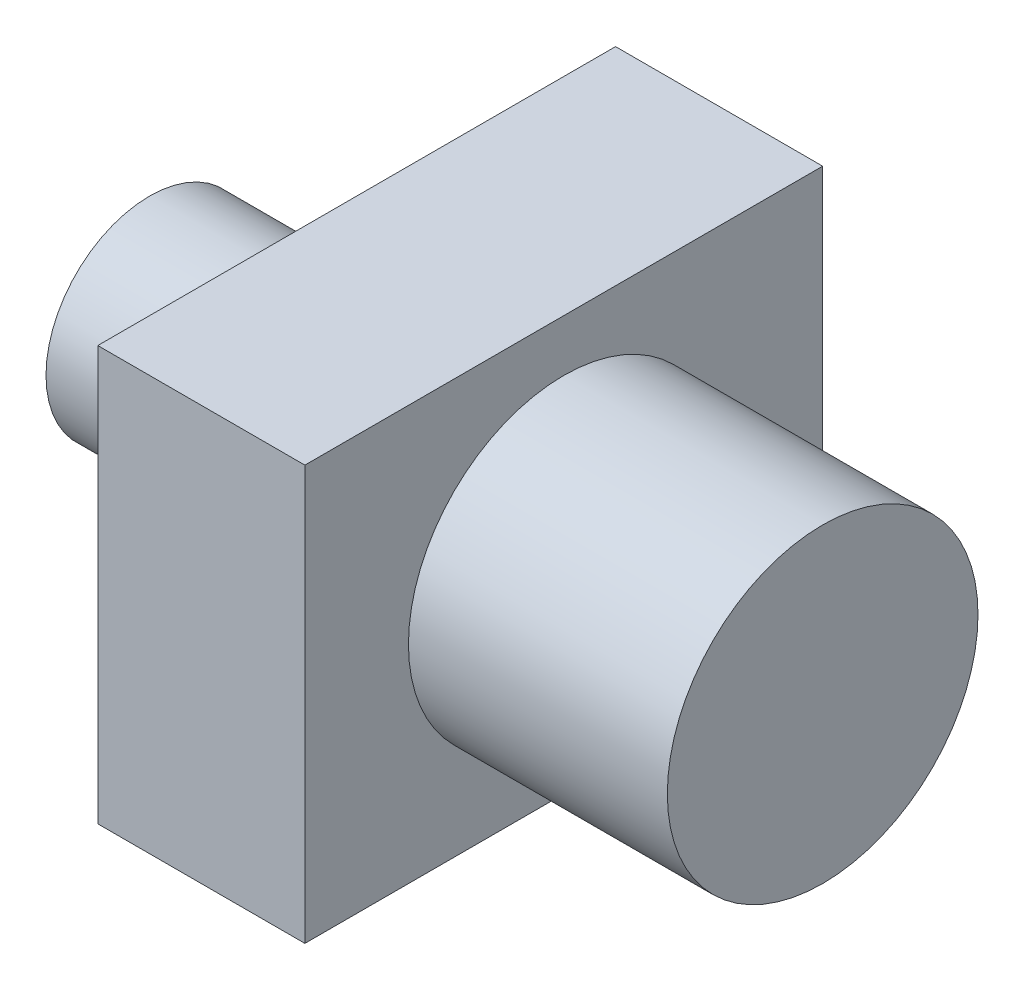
ISO-10303-21;
HEADER;
FILE_DESCRIPTION(('STEP AP214'),'2;1');
FILE_NAME('part.step','',(''),(''),'','','');
FILE_SCHEMA(('AUTOMOTIVE_DESIGN { 1 0 10303 214 1 1 1 1 }'));
ENDSEC;
DATA;
#1=APPLICATION_CONTEXT('core data for automotive mechanical design processes');
#2=APPLICATION_PROTOCOL_DEFINITION('international standard','automotive_design',2000,#1);
#3=PRODUCT_CONTEXT('',#1,'mechanical');
#4=PRODUCT('Part','Part','',(#3));
#5=PRODUCT_RELATED_PRODUCT_CATEGORY('part','',(#4));
#6=PRODUCT_DEFINITION_FORMATION('','',#4);
#7=PRODUCT_DEFINITION_CONTEXT('part definition',#1,'design');
#8=PRODUCT_DEFINITION('design','',#6,#7);
#9=PRODUCT_DEFINITION_SHAPE('','',#8);
#10=(LENGTH_UNIT() NAMED_UNIT(*) SI_UNIT(.MILLI.,.METRE.));
#11=(NAMED_UNIT(*) PLANE_ANGLE_UNIT() SI_UNIT($,.RADIAN.));
#12=(NAMED_UNIT(*) SI_UNIT($,.STERADIAN.) SOLID_ANGLE_UNIT());
#13=UNCERTAINTY_MEASURE_WITH_UNIT(LENGTH_MEASURE(1.E-05),#10,'distance_accuracy_value','');
#14=(GEOMETRIC_REPRESENTATION_CONTEXT(3) GLOBAL_UNCERTAINTY_ASSIGNED_CONTEXT((#13)) GLOBAL_UNIT_ASSIGNED_CONTEXT((#10,
#11,#12)) REPRESENTATION_CONTEXT('',''));
#15=CARTESIAN_POINT('',(0.,0.,0.));
#16=DIRECTION('',(0.,0.,1.));
#17=DIRECTION('',(1.,0.,0.));
#18=AXIS2_PLACEMENT_3D('',#15,#16,#17);
#19=CARTESIAN_POINT('',(40.,-40.,50.));
#20=DIRECTION('',(1.,0.,0.));
#21=DIRECTION('',(0.,0.,-1.));
#22=AXIS2_PLACEMENT_3D('',#19,#20,#21);
#23=PLANE('',#22);
#24=DIRECTION('',(0.,-1.,0.));
#25=VECTOR('',#24,1.);
#26=CARTESIAN_POINT('',(40.,40.,50.));
#27=LINE('',#26,#25);
#28=CARTESIAN_POINT('',(40.,40.,50.));
#29=VERTEX_POINT('',#28);
#30=CARTESIAN_POINT('',(40.,-40.,50.));
#31=VERTEX_POINT('',#30);
#32=EDGE_CURVE('E84',#29,#31,#27,.T.);
#33=ORIENTED_EDGE('',*,*,#32,.T.);
#34=DIRECTION('',(0.,0.,-1.));
#35=VECTOR('',#34,1.);
#36=CARTESIAN_POINT('',(40.,-40.,50.));
#37=LINE('',#36,#35);
#38=CARTESIAN_POINT('',(40.,-40.,-50.));
#39=VERTEX_POINT('',#38);
#40=EDGE_CURVE('E79',#31,#39,#37,.T.);
#41=ORIENTED_EDGE('',*,*,#40,.T.);
#42=DIRECTION('',(0.,1.,0.));
#43=VECTOR('',#42,1.);
#44=CARTESIAN_POINT('',(40.,40.,-50.));
#45=LINE('',#44,#43);
#46=CARTESIAN_POINT('',(40.,40.,-50.));
#47=VERTEX_POINT('',#46);
#48=EDGE_CURVE('E82',#39,#47,#45,.T.);
#49=ORIENTED_EDGE('',*,*,#48,.T.);
#50=DIRECTION('',(0.,0.,1.));
#51=VECTOR('',#50,1.);
#52=CARTESIAN_POINT('',(40.,40.,50.));
#53=LINE('',#52,#51);
#54=EDGE_CURVE('E48',#47,#29,#53,.T.);
#55=ORIENTED_EDGE('',*,*,#54,.T.);
#56=EDGE_LOOP('',(#33,#41,#49,#55));
#57=FACE_BOUND('',#56,.T.);
#58=CARTESIAN_POINT('',(40.,0.,0.));
#59=DIRECTION('',(1.,0.,0.));
#60=DIRECTION('',(0.,0.,-1.));
#61=AXIS2_PLACEMENT_3D('',#58,#59,#60);
#62=CIRCLE('',#61,30.);
#63=CARTESIAN_POINT('',(40.,0.,-30.));
#64=VERTEX_POINT('',#63);
#65=EDGE_CURVE('E190',#64,#64,#62,.T.);
#66=ORIENTED_EDGE('',*,*,#65,.F.);
#67=EDGE_LOOP('',(#66));
#68=FACE_BOUND('',#67,.T.);
#69=ADVANCED_FACE('F31',(#57,#68),#23,.T.);
#70=CARTESIAN_POINT('',(0.,-40.,50.));
#71=DIRECTION('',(1.,0.,0.));
#72=DIRECTION('',(0.,0.,-1.));
#73=AXIS2_PLACEMENT_3D('',#70,#71,#72);
#74=PLANE('',#73);
#75=DIRECTION('',(0.,-1.,0.));
#76=VECTOR('',#75,1.);
#77=CARTESIAN_POINT('',(0.,40.,50.));
#78=LINE('',#77,#76);
#79=CARTESIAN_POINT('',(0.,40.,50.));
#80=VERTEX_POINT('',#79);
#81=CARTESIAN_POINT('',(0.,-40.,50.));
#82=VERTEX_POINT('',#81);
#83=EDGE_CURVE('E98',#80,#82,#78,.T.);
#84=ORIENTED_EDGE('',*,*,#83,.F.);
#85=DIRECTION('',(0.,0.,1.));
#86=VECTOR('',#85,1.);
#87=CARTESIAN_POINT('',(0.,40.,50.));
#88=LINE('',#87,#86);
#89=CARTESIAN_POINT('',(0.,40.,-50.));
#90=VERTEX_POINT('',#89);
#91=EDGE_CURVE('E71',#90,#80,#88,.T.);
#92=ORIENTED_EDGE('',*,*,#91,.F.);
#93=DIRECTION('',(0.,1.,0.));
#94=VECTOR('',#93,1.);
#95=CARTESIAN_POINT('',(0.,40.,-50.));
#96=LINE('',#95,#94);
#97=CARTESIAN_POINT('',(0.,-40.,-50.));
#98=VERTEX_POINT('',#97);
#99=EDGE_CURVE('E65',#98,#90,#96,.T.);
#100=ORIENTED_EDGE('',*,*,#99,.F.);
#101=DIRECTION('',(0.,0.,-1.));
#102=VECTOR('',#101,1.);
#103=CARTESIAN_POINT('',(0.,-40.,50.));
#104=LINE('',#103,#102);
#105=EDGE_CURVE('E89',#82,#98,#104,.T.);
#106=ORIENTED_EDGE('',*,*,#105,.F.);
#107=EDGE_LOOP('',(#84,#92,#100,#106));
#108=FACE_BOUND('',#107,.T.);
#109=CARTESIAN_POINT('',(0.,0.,0.));
#110=DIRECTION('',(1.,0.,0.));
#111=DIRECTION('',(0.,0.,-1.));
#112=AXIS2_PLACEMENT_3D('',#109,#110,#111);
#113=CIRCLE('',#112,20.);
#114=CARTESIAN_POINT('',(0.,0.,-20.));
#115=VERTEX_POINT('',#114);
#116=EDGE_CURVE('E11',#115,#115,#113,.F.);
#117=ORIENTED_EDGE('',*,*,#116,.F.);
#118=EDGE_LOOP('',(#117));
#119=FACE_BOUND('',#118,.T.);
#120=ADVANCED_FACE('F109',(#108,#119),#74,.F.);
#121=CARTESIAN_POINT('',(40.,40.,50.));
#122=DIRECTION('',(0.,0.,-1.));
#123=DIRECTION('',(-1.,0.,0.));
#124=AXIS2_PLACEMENT_3D('',#121,#122,#123);
#125=PLANE('',#124);
#126=ORIENTED_EDGE('',*,*,#83,.T.);
#127=DIRECTION('',(-1.,0.,0.));
#128=VECTOR('',#127,1.);
#129=CARTESIAN_POINT('',(40.,-40.,50.));
#130=LINE('',#129,#128);
#131=EDGE_CURVE('E40',#31,#82,#130,.T.);
#132=ORIENTED_EDGE('',*,*,#131,.F.);
#133=ORIENTED_EDGE('',*,*,#32,.F.);
#134=DIRECTION('',(-1.,0.,0.));
#135=VECTOR('',#134,1.);
#136=CARTESIAN_POINT('',(40.,40.,50.));
#137=LINE('',#136,#135);
#138=EDGE_CURVE('E94',#29,#80,#137,.T.);
#139=ORIENTED_EDGE('',*,*,#138,.T.);
#140=EDGE_LOOP('',(#126,#132,#133,#139));
#141=FACE_BOUND('',#140,.T.);
#142=ADVANCED_FACE('F33',(#141),#125,.F.);
#143=CARTESIAN_POINT('',(40.,-40.,50.));
#144=DIRECTION('',(0.,1.,0.));
#145=DIRECTION('',(0.,0.,1.));
#146=AXIS2_PLACEMENT_3D('',#143,#144,#145);
#147=PLANE('',#146);
#148=ORIENTED_EDGE('',*,*,#105,.T.);
#149=DIRECTION('',(-1.,0.,0.));
#150=VECTOR('',#149,1.);
#151=CARTESIAN_POINT('',(40.,-40.,-50.));
#152=LINE('',#151,#150);
#153=EDGE_CURVE('E87',#39,#98,#152,.T.);
#154=ORIENTED_EDGE('',*,*,#153,.F.);
#155=ORIENTED_EDGE('',*,*,#40,.F.);
#156=ORIENTED_EDGE('',*,*,#131,.T.);
#157=EDGE_LOOP('',(#148,#154,#155,#156));
#158=FACE_BOUND('',#157,.T.);
#159=ADVANCED_FACE('F88',(#158),#147,.F.);
#160=CARTESIAN_POINT('',(40.,40.,-50.));
#161=DIRECTION('',(0.,0.,1.));
#162=DIRECTION('',(1.,0.,0.));
#163=AXIS2_PLACEMENT_3D('',#160,#161,#162);
#164=PLANE('',#163);
#165=ORIENTED_EDGE('',*,*,#99,.T.);
#166=DIRECTION('',(-1.,0.,0.));
#167=VECTOR('',#166,1.);
#168=CARTESIAN_POINT('',(40.,40.,-50.));
#169=LINE('',#168,#167);
#170=EDGE_CURVE('E90',#47,#90,#169,.T.);
#171=ORIENTED_EDGE('',*,*,#170,.F.);
#172=ORIENTED_EDGE('',*,*,#48,.F.);
#173=ORIENTED_EDGE('',*,*,#153,.T.);
#174=EDGE_LOOP('',(#165,#171,#172,#173));
#175=FACE_BOUND('',#174,.T.);
#176=ADVANCED_FACE('F92',(#175),#164,.F.);
#177=CARTESIAN_POINT('',(40.,40.,50.));
#178=DIRECTION('',(0.,-1.,0.));
#179=DIRECTION('',(0.,0.,-1.));
#180=AXIS2_PLACEMENT_3D('',#177,#178,#179);
#181=PLANE('',#180);
#182=ORIENTED_EDGE('',*,*,#91,.T.);
#183=ORIENTED_EDGE('',*,*,#138,.F.);
#184=ORIENTED_EDGE('',*,*,#54,.F.);
#185=ORIENTED_EDGE('',*,*,#170,.T.);
#186=EDGE_LOOP('',(#182,#183,#184,#185));
#187=FACE_BOUND('',#186,.T.);
#188=ADVANCED_FACE('F118',(#187),#181,.F.);
#189=CARTESIAN_POINT('',(-40.,0.,0.));
#190=DIRECTION('',(1.,0.,0.));
#191=DIRECTION('',(0.,0.,-1.));
#192=AXIS2_PLACEMENT_3D('',#189,#190,#191);
#193=CYLINDRICAL_SURFACE('',#192,20.);
#194=CARTESIAN_POINT('',(-40.,0.,0.));
#195=DIRECTION('',(-1.,0.,0.));
#196=DIRECTION('',(0.,0.,1.));
#197=AXIS2_PLACEMENT_3D('',#194,#195,#196);
#198=CIRCLE('',#197,20.);
#199=CARTESIAN_POINT('',(-40.,0.,20.));
#200=VERTEX_POINT('',#199);
#201=EDGE_CURVE('E101',#200,#200,#198,.T.);
#202=ORIENTED_EDGE('',*,*,#201,.F.);
#203=EDGE_LOOP('',(#202));
#204=FACE_BOUND('',#203,.T.);
#205=ORIENTED_EDGE('',*,*,#116,.T.);
#206=EDGE_LOOP('',(#205));
#207=FACE_BOUND('',#206,.T.);
#208=ADVANCED_FACE('F115',(#204,#207),#193,.T.);
#209=CARTESIAN_POINT('',(-40.,0.,0.));
#210=DIRECTION('',(-1.,0.,0.));
#211=DIRECTION('',(0.,0.,1.));
#212=AXIS2_PLACEMENT_3D('',#209,#210,#211);
#213=PLANE('',#212);
#214=ORIENTED_EDGE('',*,*,#201,.T.);
#215=EDGE_LOOP('',(#214));
#216=FACE_BOUND('',#215,.T.);
#217=ADVANCED_FACE('F117',(#216),#213,.T.);
#218=CARTESIAN_POINT('',(90.,0.,0.));
#219=DIRECTION('',(-1.,0.,0.));
#220=DIRECTION('',(0.,0.,1.));
#221=AXIS2_PLACEMENT_3D('',#218,#219,#220);
#222=CYLINDRICAL_SURFACE('',#221,30.);
#223=CARTESIAN_POINT('',(90.,0.,0.));
#224=DIRECTION('',(1.,0.,0.));
#225=DIRECTION('',(0.,0.,-1.));
#226=AXIS2_PLACEMENT_3D('',#223,#224,#225);
#227=CIRCLE('',#226,30.);
#228=CARTESIAN_POINT('',(90.,0.,-30.));
#229=VERTEX_POINT('',#228);
#230=EDGE_CURVE('E189',#229,#229,#227,.T.);
#231=ORIENTED_EDGE('',*,*,#230,.F.);
#232=EDGE_LOOP('',(#231));
#233=FACE_BOUND('',#232,.T.);
#234=ORIENTED_EDGE('',*,*,#65,.T.);
#235=EDGE_LOOP('',(#234));
#236=FACE_BOUND('',#235,.T.);
#237=ADVANCED_FACE('F125',(#233,#236),#222,.T.);
#238=CARTESIAN_POINT('',(90.,0.,0.));
#239=DIRECTION('',(1.,0.,0.));
#240=DIRECTION('',(0.,0.,-1.));
#241=AXIS2_PLACEMENT_3D('',#238,#239,#240);
#242=PLANE('',#241);
#243=ORIENTED_EDGE('',*,*,#230,.T.);
#244=EDGE_LOOP('',(#243));
#245=FACE_BOUND('',#244,.T.);
#246=ADVANCED_FACE('F173',(#245),#242,.T.);
#247=CLOSED_SHELL('',(#69,#120,#142,#159,#176,#188,#208,#217,#237,#246));
#248=MANIFOLD_SOLID_BREP('B2',#247);
#249=ADVANCED_BREP_SHAPE_REPRESENTATION('',(#18,#248),#14);
#250=SHAPE_DEFINITION_REPRESENTATION(#9,#249);
ENDSEC;
END-ISO-10303-21;
